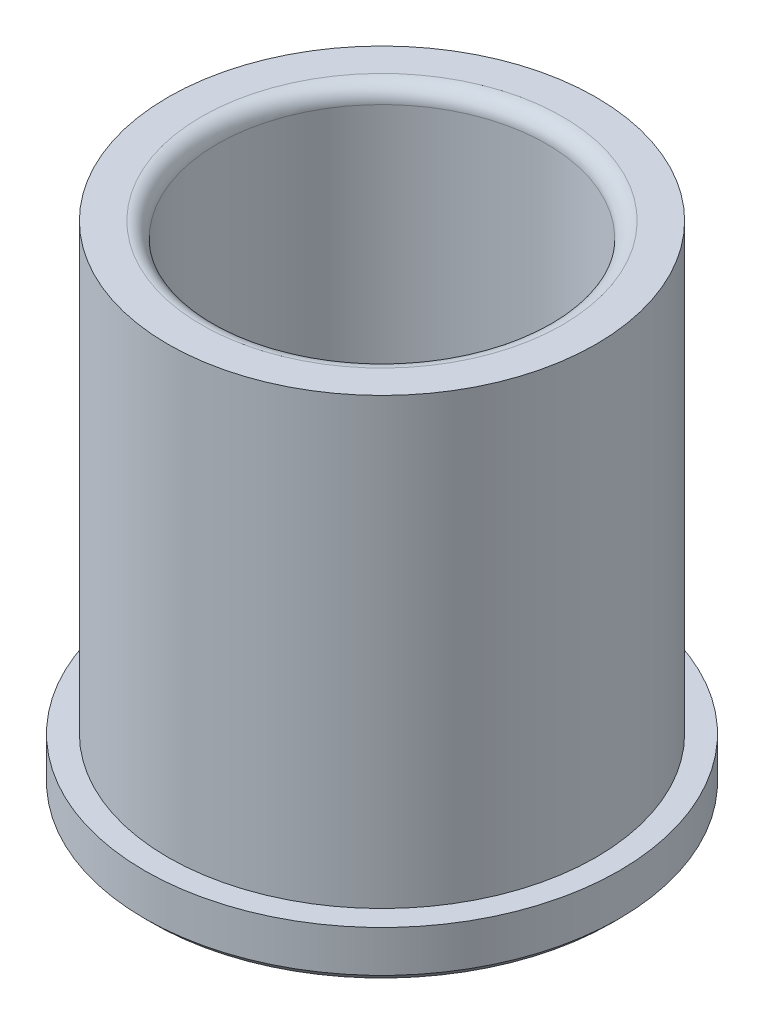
ISO-10303-21;
HEADER;
FILE_DESCRIPTION(('STEP AP214'),'2;1');
FILE_NAME('part.step','',(''),(''),'','','');
FILE_SCHEMA(('AUTOMOTIVE_DESIGN { 1 0 10303 214 1 1 1 1 }'));
ENDSEC;
DATA;
#1=APPLICATION_CONTEXT('core data for automotive mechanical design processes');
#2=APPLICATION_PROTOCOL_DEFINITION('international standard','automotive_design',2000,#1);
#3=PRODUCT_CONTEXT('',#1,'mechanical');
#4=PRODUCT('Part','Part','',(#3));
#5=PRODUCT_RELATED_PRODUCT_CATEGORY('part','',(#4));
#6=PRODUCT_DEFINITION_FORMATION('','',#4);
#7=PRODUCT_DEFINITION_CONTEXT('part definition',#1,'design');
#8=PRODUCT_DEFINITION('design','',#6,#7);
#9=PRODUCT_DEFINITION_SHAPE('','',#8);
#10=(LENGTH_UNIT() NAMED_UNIT(*) SI_UNIT(.MILLI.,.METRE.));
#11=(NAMED_UNIT(*) PLANE_ANGLE_UNIT() SI_UNIT($,.RADIAN.));
#12=(NAMED_UNIT(*) SI_UNIT($,.STERADIAN.) SOLID_ANGLE_UNIT());
#13=UNCERTAINTY_MEASURE_WITH_UNIT(LENGTH_MEASURE(1.E-05),#10,'distance_accuracy_value','');
#14=(GEOMETRIC_REPRESENTATION_CONTEXT(3) GLOBAL_UNCERTAINTY_ASSIGNED_CONTEXT((#13)) GLOBAL_UNIT_ASSIGNED_CONTEXT((#10,
#11,#12)) REPRESENTATION_CONTEXT('',''));
#15=CARTESIAN_POINT('',(0.,0.,0.));
#16=DIRECTION('',(0.,0.,1.));
#17=DIRECTION('',(1.,0.,0.));
#18=AXIS2_PLACEMENT_3D('',#15,#16,#17);
#19=CARTESIAN_POINT('',(3.49148336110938E-12,-1000.,0.));
#20=DIRECTION('',(0.,-1.,0.));
#21=DIRECTION('',(1.,0.,0.));
#22=AXIS2_PLACEMENT_3D('',#19,#20,#21);
#23=CYLINDRICAL_SURFACE('',#22,20.6438499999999);
#24=CARTESIAN_POINT('',(0.,4.7625,0.));
#25=DIRECTION('',(0.,-1.,0.));
#26=DIRECTION('',(1.,0.,0.));
#27=AXIS2_PLACEMENT_3D('',#24,#25,#26);
#28=CIRCLE('',#27,20.64385);
#29=CARTESIAN_POINT('',(20.6438499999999,4.76250000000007,0.));
#30=VERTEX_POINT('',#29);
#31=EDGE_CURVE('E60',#30,#30,#28,.T.);
#32=ORIENTED_EDGE('',*,*,#31,.F.);
#33=EDGE_LOOP('',(#32));
#34=FACE_BOUND('',#33,.T.);
#35=CARTESIAN_POINT('',(-1.66281895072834E-13,47.625,0.));
#36=DIRECTION('',(0.,-1.,0.));
#37=DIRECTION('',(1.,0.,0.));
#38=AXIS2_PLACEMENT_3D('',#35,#36,#37);
#39=CIRCLE('',#38,20.6438499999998);
#40=CARTESIAN_POINT('',(20.6438499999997,47.6250000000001,0.));
#41=VERTEX_POINT('',#40);
#42=EDGE_CURVE('E39',#41,#41,#39,.T.);
#43=ORIENTED_EDGE('',*,*,#42,.T.);
#44=EDGE_LOOP('',(#43));
#45=FACE_BOUND('',#44,.T.);
#46=ADVANCED_FACE('F28',(#34,#45),#23,.T.);
#47=CARTESIAN_POINT('',(-20.64385,47.625,0.));
#48=DIRECTION('',(0.,-1.,0.));
#49=DIRECTION('',(1.,0.,0.));
#50=AXIS2_PLACEMENT_3D('',#47,#48,#49);
#51=PLANE('',#50);
#52=CARTESIAN_POINT('',(-1.66281895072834E-13,47.6250000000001,0.));
#53=DIRECTION('',(0.,-1.,0.));
#54=DIRECTION('',(1.,0.,0.));
#55=AXIS2_PLACEMENT_3D('',#52,#53,#54);
#56=CIRCLE('',#55,17.4053499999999);
#57=CARTESIAN_POINT('',(17.4053499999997,47.6250000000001,0.));
#58=VERTEX_POINT('',#57);
#59=EDGE_CURVE('E35',#58,#58,#56,.T.);
#60=ORIENTED_EDGE('',*,*,#59,.T.);
#61=EDGE_LOOP('',(#60));
#62=FACE_BOUND('',#61,.T.);
#63=ORIENTED_EDGE('',*,*,#42,.F.);
#64=EDGE_LOOP('',(#63));
#65=FACE_BOUND('',#64,.T.);
#66=ADVANCED_FACE('F68',(#62,#65),#51,.F.);
#67=CARTESIAN_POINT('',(3.49148336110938E-12,-1000.,0.));
#68=DIRECTION('',(0.,-1.,0.));
#69=DIRECTION('',(1.,0.,0.));
#70=AXIS2_PLACEMENT_3D('',#67,#68,#69);
#71=CYLINDRICAL_SURFACE('',#70,15.8813499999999);
#72=CARTESIAN_POINT('',(-1.60960874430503E-13,46.1009999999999,0.));
#73=DIRECTION('',(0.,-1.,0.));
#74=DIRECTION('',(1.,0.,0.));
#75=AXIS2_PLACEMENT_3D('',#72,#73,#74);
#76=CIRCLE('',#75,15.8813499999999);
#77=CARTESIAN_POINT('',(15.8813499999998,46.101,0.));
#78=VERTEX_POINT('',#77);
#79=EDGE_CURVE('E10',#78,#78,#76,.F.);
#80=ORIENTED_EDGE('',*,*,#79,.T.);
#81=EDGE_LOOP('',(#80));
#82=FACE_BOUND('',#81,.T.);
#83=CARTESIAN_POINT('',(0.,0.761999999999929,0.));
#84=DIRECTION('',(0.,-1.,0.));
#85=DIRECTION('',(1.,0.,0.));
#86=AXIS2_PLACEMENT_3D('',#83,#84,#85);
#87=CIRCLE('',#86,15.88135);
#88=CARTESIAN_POINT('',(15.88135,0.761999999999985,0.));
#89=VERTEX_POINT('',#88);
#90=EDGE_CURVE('E43',#89,#89,#87,.T.);
#91=ORIENTED_EDGE('',*,*,#90,.T.);
#92=EDGE_LOOP('',(#91));
#93=FACE_BOUND('',#92,.T.);
#94=ADVANCED_FACE('F72',(#82,#93),#71,.F.);
#95=CARTESIAN_POINT('',(0.,0.,0.));
#96=DIRECTION('',(0.,-1.,0.));
#97=DIRECTION('',(1.,0.,0.));
#98=AXIS2_PLACEMENT_3D('',#95,#96,#97);
#99=CONICAL_SURFACE('',#98,16.64335,0.785398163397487);
#100=ORIENTED_EDGE('',*,*,#90,.F.);
#101=EDGE_LOOP('',(#100));
#102=FACE_BOUND('',#101,.T.);
#103=CARTESIAN_POINT('',(0.,0.,0.));
#104=DIRECTION('',(0.,-1.,0.));
#105=DIRECTION('',(1.,0.,0.));
#106=AXIS2_PLACEMENT_3D('',#103,#104,#105);
#107=CIRCLE('',#106,16.64335);
#108=CARTESIAN_POINT('',(16.64335,0.,0.));
#109=VERTEX_POINT('',#108);
#110=EDGE_CURVE('E48',#109,#109,#107,.T.);
#111=ORIENTED_EDGE('',*,*,#110,.T.);
#112=EDGE_LOOP('',(#111));
#113=FACE_BOUND('',#112,.T.);
#114=ADVANCED_FACE('F77',(#102,#113),#99,.F.);
#115=CARTESIAN_POINT('',(-16.64335,0.,0.));
#116=DIRECTION('',(0.,1.,0.));
#117=DIRECTION('',(-1.,0.,0.));
#118=AXIS2_PLACEMENT_3D('',#115,#116,#117);
#119=PLANE('',#118);
#120=ORIENTED_EDGE('',*,*,#110,.F.);
#121=EDGE_LOOP('',(#120));
#122=FACE_BOUND('',#121,.T.);
#123=CARTESIAN_POINT('',(0.,0.,0.));
#124=DIRECTION('',(0.,-1.,0.));
#125=DIRECTION('',(1.,0.,0.));
#126=AXIS2_PLACEMENT_3D('',#123,#124,#125);
#127=CIRCLE('',#126,22.1234);
#128=CARTESIAN_POINT('',(22.1234,0.,0.));
#129=VERTEX_POINT('',#128);
#130=EDGE_CURVE('E51',#129,#129,#127,.T.);
#131=ORIENTED_EDGE('',*,*,#130,.T.);
#132=EDGE_LOOP('',(#131));
#133=FACE_BOUND('',#132,.T.);
#134=ADVANCED_FACE('F82',(#122,#133),#119,.F.);
#135=CARTESIAN_POINT('',(0.,0.761999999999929,0.));
#136=DIRECTION('',(0.,1.,0.));
#137=DIRECTION('',(-1.,0.,0.));
#138=AXIS2_PLACEMENT_3D('',#135,#136,#137);
#139=CONICAL_SURFACE('',#138,22.8854,0.785398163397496);
#140=ORIENTED_EDGE('',*,*,#130,.F.);
#141=EDGE_LOOP('',(#140));
#142=FACE_BOUND('',#141,.T.);
#143=CARTESIAN_POINT('',(0.,0.761999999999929,0.));
#144=DIRECTION('',(0.,-1.,0.));
#145=DIRECTION('',(1.,0.,0.));
#146=AXIS2_PLACEMENT_3D('',#143,#144,#145);
#147=CIRCLE('',#146,22.8854);
#148=CARTESIAN_POINT('',(22.8854,0.762000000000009,0.));
#149=VERTEX_POINT('',#148);
#150=EDGE_CURVE('E54',#149,#149,#147,.T.);
#151=ORIENTED_EDGE('',*,*,#150,.T.);
#152=EDGE_LOOP('',(#151));
#153=FACE_BOUND('',#152,.T.);
#154=ADVANCED_FACE('F86',(#142,#153),#139,.T.);
#155=CARTESIAN_POINT('',(3.49148336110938E-12,-1000.,0.));
#156=DIRECTION('',(0.,-1.,0.));
#157=DIRECTION('',(1.,0.,0.));
#158=AXIS2_PLACEMENT_3D('',#155,#156,#157);
#159=CYLINDRICAL_SURFACE('',#158,22.8854);
#160=ORIENTED_EDGE('',*,*,#150,.F.);
#161=EDGE_LOOP('',(#160));
#162=FACE_BOUND('',#161,.T.);
#163=CARTESIAN_POINT('',(0.,4.7625,0.));
#164=DIRECTION('',(0.,-1.,0.));
#165=DIRECTION('',(1.,0.,0.));
#166=AXIS2_PLACEMENT_3D('',#163,#164,#165);
#167=CIRCLE('',#166,22.8854);
#168=CARTESIAN_POINT('',(22.8854,4.76250000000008,0.));
#169=VERTEX_POINT('',#168);
#170=EDGE_CURVE('E57',#169,#169,#167,.T.);
#171=ORIENTED_EDGE('',*,*,#170,.T.);
#172=EDGE_LOOP('',(#171));
#173=FACE_BOUND('',#172,.T.);
#174=ADVANCED_FACE('F90',(#162,#173),#159,.T.);
#175=CARTESIAN_POINT('',(-22.8854,4.76249999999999,0.));
#176=DIRECTION('',(0.,-1.,0.));
#177=DIRECTION('',(1.,0.,0.));
#178=AXIS2_PLACEMENT_3D('',#175,#176,#177);
#179=PLANE('',#178);
#180=ORIENTED_EDGE('',*,*,#170,.F.);
#181=EDGE_LOOP('',(#180));
#182=FACE_BOUND('',#181,.T.);
#183=ORIENTED_EDGE('',*,*,#31,.T.);
#184=EDGE_LOOP('',(#183));
#185=FACE_BOUND('',#184,.T.);
#186=ADVANCED_FACE('F64',(#182,#185),#179,.F.);
#187=CARTESIAN_POINT('',(-1.60960874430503E-13,46.1009999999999,0.));
#188=DIRECTION('',(0.,-1.,0.));
#189=DIRECTION('',(1.,0.,0.));
#190=AXIS2_PLACEMENT_3D('',#187,#188,#189);
#191=TOROIDAL_SURFACE('',#190,17.4053499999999,1.524);
#192=ORIENTED_EDGE('',*,*,#79,.F.);
#193=EDGE_LOOP('',(#192));
#194=FACE_BOUND('',#193,.T.);
#195=ORIENTED_EDGE('',*,*,#59,.F.);
#196=EDGE_LOOP('',(#195));
#197=FACE_BOUND('',#196,.T.);
#198=ADVANCED_FACE('F30',(#194,#197),#191,.T.);
#199=CLOSED_SHELL('',(#46,#66,#94,#114,#134,#154,#174,#186,#198));
#200=MANIFOLD_SOLID_BREP('B2',#199);
#201=ADVANCED_BREP_SHAPE_REPRESENTATION('',(#18,#200),#14);
#202=SHAPE_DEFINITION_REPRESENTATION(#9,#201);
ENDSEC;
END-ISO-10303-21;
